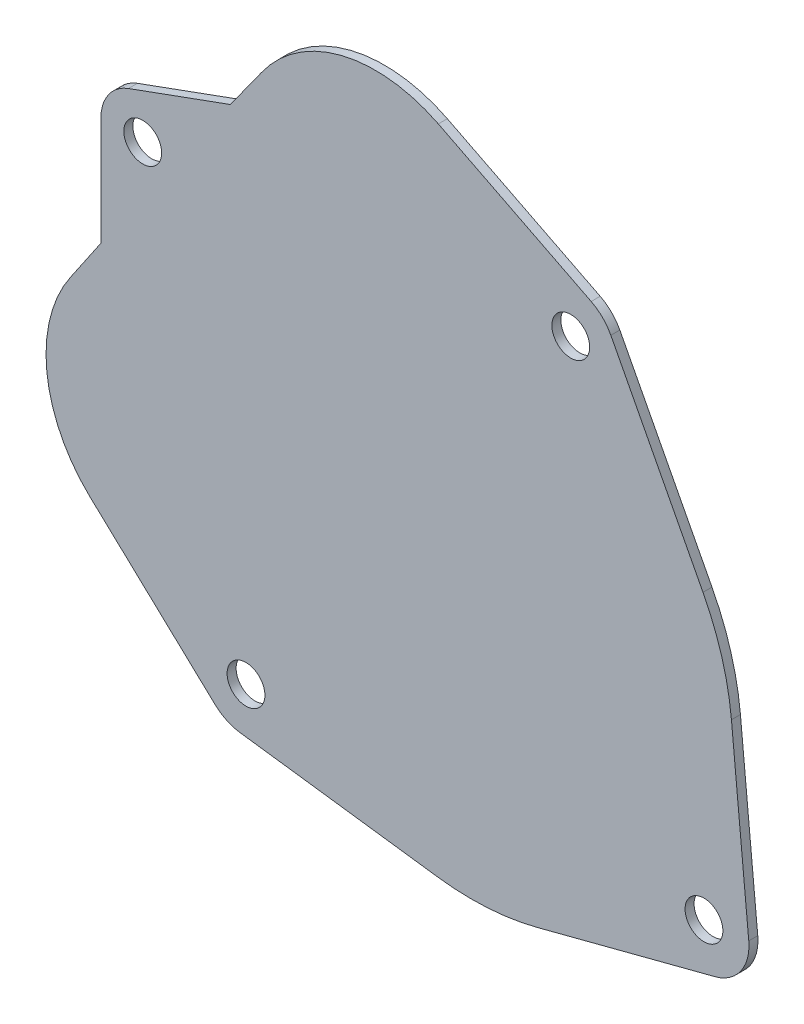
from build123d import *

# Parameters (mm, degrees)
ESQUISSE1_R          = 2.1
BASE_EXTRUSION_DEPTH = 0.5


with BuildPart() as part:
    # Esquisse1 → Base-Extrusion (new, symmetric)
    with BuildSketch(Plane.XY):
        with BuildLine():
            Line((35.615327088, -25.672223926), (33.690495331, -5.355736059))
            ThreePointArc((33.690495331, -5.355736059), (32.627582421, 0.138570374), (30.529161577, 5.326423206))
            Line((30.529161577, 5.326423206), (20.291189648, 24.943575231))
            ThreePointArc((20.291189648, 24.943575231), (19.367522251, 26.19363098), (18.105897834, 27.101433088))
            Line((18.105897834, 27.101433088), (1.120998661, 35.694422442))
            ThreePointArc((1.120998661, 35.694422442), (-9.646140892, 36.898255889), (-18.57139047, 30.756559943))
            Line((-18.57139047, 30.756559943), (-21.986449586, 26.007166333))
            Line((-21.986449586, 26.007166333), (-33.307069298, 21.886797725))
            ThreePointArc((-33.307069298, 21.886797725), (-35.52580407, 20.184302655), (-36.366774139, 17.517086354))
            Line((-36.366774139, 17.517086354), (-36.366774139, 5.469934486))
            Line((-36.366774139, 5.469934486), (-39.661725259, 0.636440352))
            ThreePointArc((-39.661725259, 0.636440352), (-42.380416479, -9.851134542), (-37.566604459, -19.557200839))
            Line((-37.566604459, -19.557200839), (-23.682658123, -32.578809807))
            ThreePointArc((-23.682658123, -32.578809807), (-22.398102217, -33.453862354), (-20.907521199, -33.894281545))
            Line((-20.907521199, -33.894281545), (1.028164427, -36.805367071))
            ThreePointArc((1.028164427, -36.805367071), (6.620853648, -37.002887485), (12.147350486, -36.122535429))
            Line((12.147350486, -36.122535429), (31.896935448, -30.982637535))
            ThreePointArc((31.896935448, -30.982637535), (34.733377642, -29.011706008), (35.615327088, -25.672223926))
        make_face()
        with Locations((15.838548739, 22.619791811)):
            Circle(ESQUISSE1_R, mode=Mode.SUBTRACT)
        with Locations((-31.716624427, 17.517086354)):
            Circle(ESQUISSE1_R, mode=Mode.SUBTRACT)
        with Locations((-20.246771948, -28.915387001)):
            Circle(ESQUISSE1_R, mode=Mode.SUBTRACT)
        with Locations((30.63761742, -26.143823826)):
            Circle(ESQUISSE1_R, mode=Mode.SUBTRACT)
    extrude(amount=BASE_EXTRUSION_DEPTH, both=True)


solid = part.part
